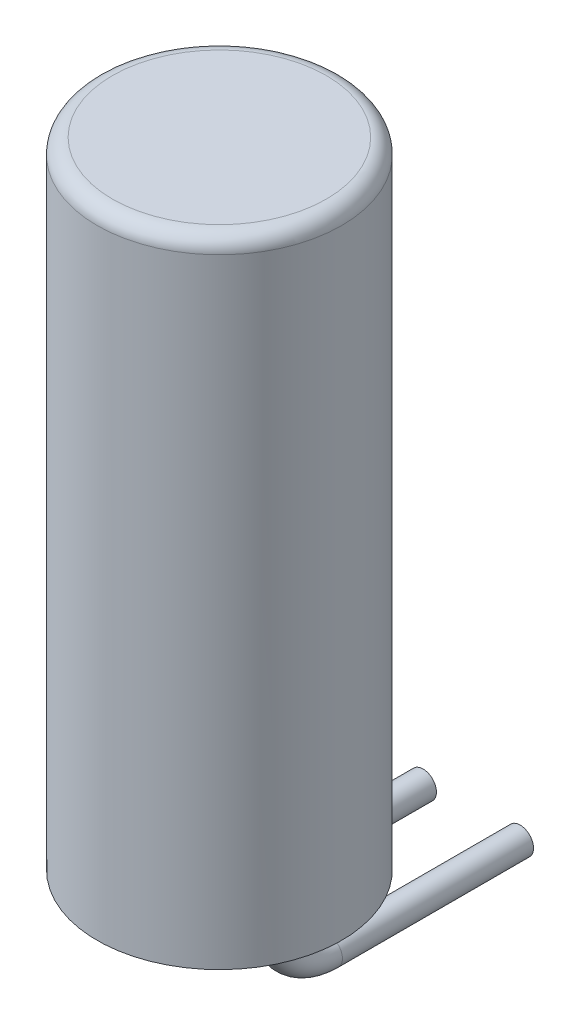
from build123d import *

# Parameters (mm, degrees)
ESQUISSE1_R        = 1.6
BOSS_EXTRU_1_DEPTH = 8.3
CONG_1_R           = 0.2
ESQUISSE2_R        = 0.175


with BuildPart() as part:
    # Esquisse1 → Boss.-Extru.1 (new body)
    with BuildSketch(Plane(origin=(0, 0, 0), x_dir=(1, 0, 0), z_dir=(0, 1, 0))):
        with Locations(Location((0, 0, 0), (0, 0, 90))):
            Circle(ESQUISSE1_R)
    extrude(amount=BOSS_EXTRU_1_DEPTH)

    # Cong_1
    cong_1_edges = [part.edges().sort_by_distance(p)[0] for p in [
        (0, 8.3, 1.6),
    ]]
    fillet(cong_1_edges, radius=CONG_1_R)

    # Balayage1: sweep along a path in Esquisse3
    with BuildLine(Plane(origin=(0.635, 0, 0), x_dir=(0, 0, -1), z_dir=(1, 0, 0))) as balayage1_path:
        Line((0, 0), (0, -0.2))
        ThreePointArc((0, -0.2), (0.234314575, -0.765685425), (0.8, -1))
        Line((0.8, -1), (3.3, -1))
    # Esquisse2 → Balayage1 (sweep)
    with BuildSketch(Plane.XZ):
        with Locations((0.635, 0)):
            Circle(ESQUISSE2_R)
        with Locations((-0.635, 0)):
            Circle(ESQUISSE2_R)
    sweep(path=balayage1_path.line)


solid = part.part
